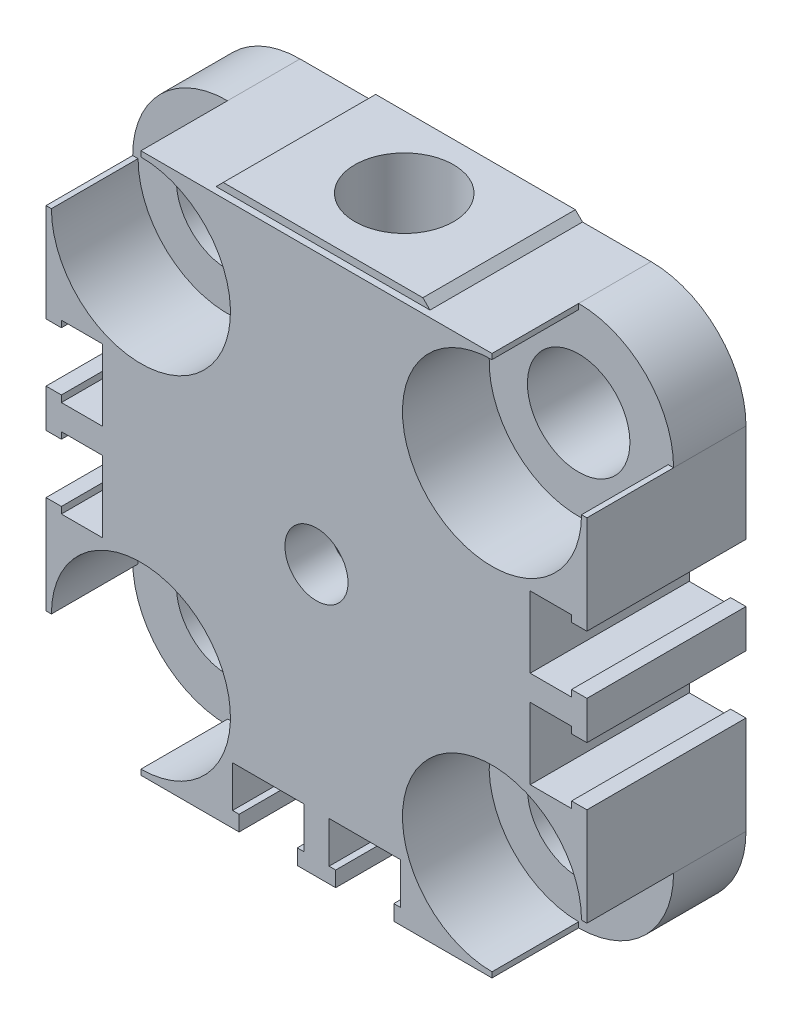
from build123d import *

# Parameters (mm, degrees)
EXTRUSION1_DEPTH                    = 14.5
ENL_V_MAT_EXTRU_1_DEPTH             = 7.9
ESQUISSE3_R                         = 4.67
ENL_V_MAT_EXTRU_2_DEPTH             = 7.9
R_P_TITION_CIRCULAIRE1_COUNT        = 4
ESQUISSE4_R                         = 2.875
ENL_V_MAT_EXTRU_3_DEPTH             = 4
ENL_V_MAT_EXTRU_4_DEPTH             = 38.755728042
R_P_TITION_CIRCULAIRE2_COUNT        = 3
R_P_TITION_CIRCULAIRE2_ANGLE        = 180
R_P_TITION_CIRCULAIRE2_COPY_1_DEPTH = 38.755728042
R_P_TITION_CIRCULAIRE2_COPY_2_DEPTH = 38.755728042
ESQUISSE7_W                         = 0.5
ESQUISSE7_H                         = 16
ESQUISSE9_W                         = 9
ESQUISSE9_H                         = 10.4
ESQUISSE9_W_2                       = 0.7
ESQUISSE9_H_2                       = 1.25
EXTRUSION2_DEPTH                    = 13.9
TROU_TARAUD_M10X1_01_D              = 9
TROU_TARAUD_M10X1_01_DEPTH          = 13
TROU_TARAUD_M10X1_01_TIP            = 2.703872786
ENL_V_MAT_EXTRU_5_REACH             = 40.183
ENL_V_MAT_EXTRU_5_END_RADIUS        = 4.5
ESQUISSE14_R                        = 0.85
ENL_V_MAT_EXTRU_5_DIRECTION_2_DEPTH = 39.183275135


with BuildPart() as part:
    # Esquisse1 → Extrusion1 (new body)
    with BuildSketch(Plane.XY):
        with BuildLine():
            Line((-16, 24.65), (16, 24.65))
            ThreePointArc((16, 24.65), (22.116473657, 22.116473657), (24.65, 16))
            Line((24.65, 16), (24.65, -16))
            ThreePointArc((24.65, -16), (22.116473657, -22.116473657), (16, -24.65))
            Line((16, -24.65), (-16, -24.65))
            ThreePointArc((-16, -24.65), (-22.116473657, -22.116473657), (-24.65, -16))
            Line((-24.65, -16), (-24.65, 16))
            ThreePointArc((-24.65, 16), (-22.116473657, 22.116473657), (-16, 24.65))
        make_face()
    extrude(amount=-EXTRUSION1_DEPTH)

    # Esquisse2 → Enl_v. mat.-Extru.1 (cut)
    with BuildSketch(Plane.XY):
        with BuildLine():
            Line((-16, 24.16), (-16, 24.65))
            ThreePointArc((-16, 24.65), (-22.116473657, 22.116473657), (-24.65, 16))
            Line((-24.65, 16), (-24.16, 16))
            ThreePointArc((-24.16, 16), (-10.230008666, 10.230008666), (-16, 24.16))
        make_face()
    enl_v_mat_extru_1 = extrude(amount=-ENL_V_MAT_EXTRU_1_DEPTH, mode=Mode.SUBTRACT)

    # Esquisse3 → Enl_v. mat.-Extru.2 (cut)
    with BuildSketch(Plane.XY.offset(-7.9)):
        with Locations((-16, 16)):
            Circle(ESQUISSE3_R)
    enl_v_mat_extru_2 = extrude(amount=-ENL_V_MAT_EXTRU_2_DEPTH, mode=Mode.SUBTRACT)

    # R_p_tition circulaire1: Enl_v. mat.-Extru.1, Enl_v. mat.-Extru.2 ×4 about axis
    r_p_tition_circulaire1_axis = Axis((0, 0, 0), (0, 0, 1))
    add([enl_v_mat_extru_1.rotate(r_p_tition_circulaire1_axis, i * 360 / R_P_TITION_CIRCULAIRE1_COUNT) for i in range(1, R_P_TITION_CIRCULAIRE1_COUNT)], mode=Mode.SUBTRACT)
    add([enl_v_mat_extru_2.rotate(r_p_tition_circulaire1_axis, i * 360 / R_P_TITION_CIRCULAIRE1_COUNT) for i in range(1, R_P_TITION_CIRCULAIRE1_COUNT)], mode=Mode.SUBTRACT)

    # Esquisse4 → Enl_v. mat.-Extru.3 (cut)
    with BuildSketch(Plane.XY):
        Circle(ESQUISSE4_R)
    extrude(amount=-ENL_V_MAT_EXTRU_3_DEPTH, mode=Mode.SUBTRACT)

    # Esquisse6 → Enl_v. mat.-Extru.4 (cut, through all)
    with BuildSketch(Plane.XY):
        Polygon((-24.65, 7.05), (-23.25, 7.05), (-23.25, 7.65), (-19.48, 7.65), (-19.48, 1.15), (-23.25, 1.15), (-23.25, 1.75), (-24.65, 1.75), align=None)
    enl_v_mat_extru_4 = extrude(amount=-ENL_V_MAT_EXTRU_4_DEPTH, mode=Mode.SUBTRACT)

    # Sym_trie1: Enl_v. mat.-Extru.4 across plane
    add(enl_v_mat_extru_4.mirror(Plane.ZX), mode=Mode.SUBTRACT)

    # R_p_tition circulaire2: Enl_v. mat.-Extru.4 ×3 about axis
    r_p_tition_circulaire2_axis = Axis((0, 0, 0), (0, 0, 1))
    for i in range(1, R_P_TITION_CIRCULAIRE2_COUNT):
        add(enl_v_mat_extru_4.rotate(r_p_tition_circulaire2_axis, i * R_P_TITION_CIRCULAIRE2_ANGLE / (R_P_TITION_CIRCULAIRE2_COUNT - 1)), mode=Mode.SUBTRACT)

    # R_p_tition circulaire2 copy 1 sketch → R_p_tition circulaire2 copy 1 (cut, through all)
    with BuildSketch(Plane(origin=(0, 0, 0), x_dir=(0, 1, 0), z_dir=(0, 0, 1))):
        Polygon((-24.65, -7.05), (-23.25, -7.05), (-23.25, -7.65), (-19.48, -7.65), (-19.48, -1.15), (-23.25, -1.15), (-23.25, -1.75), (-24.65, -1.75), align=None)
    extrude(amount=-R_P_TITION_CIRCULAIRE2_COPY_1_DEPTH, mode=Mode.SUBTRACT)

    # R_p_tition circulaire2 copy 2 sketch → R_p_tition circulaire2 copy 2 (cut, through all)
    with BuildSketch(Plane(origin=(0, 0, 0), x_dir=(-1, 0, 0), z_dir=(0, 0, 1))):
        Polygon((-24.65, -7.05), (-23.25, -7.05), (-23.25, -7.65), (-19.48, -7.65), (-19.48, -1.15), (-23.25, -1.15), (-23.25, -1.75), (-24.65, -1.75), align=None)
    extrude(amount=-R_P_TITION_CIRCULAIRE2_COPY_2_DEPTH, mode=Mode.SUBTRACT)

    # Esquisse7 → R_volution1 (revolve)
    with BuildSketch(Plane(origin=(0, 0, 0), x_dir=(0, 0, -1), z_dir=(1, 0, 0)), mode=Mode.PRIVATE) as r_volution1_sk:
        with Locations((14.75, 8)):
            Rectangle(ESQUISSE7_W, ESQUISSE7_H)
    revolve(r_volution1_sk.sketch.rotate(Axis((0, 0, -26.289994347), (0, 0, -1)), 90), axis=Axis((0, 0, -26.289994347), (0, 0, -1)))

    # Esquisse9 → Enl_vement de mati_re-R_volution3 (revolve, cut)
    with BuildSketch(Plane(origin=(0, 0, 0), x_dir=(0, 0, -1), z_dir=(1, 0, 0)), mode=Mode.PRIVATE) as enl_vement_de_mati_re_r_volution3_sk:
        with Locations((10.5, 5.2)):
            Rectangle(ESQUISSE9_W, ESQUISSE9_H)
        with Locations((14.15, 16.625)):
            Rectangle(ESQUISSE9_W_2, ESQUISSE9_H_2)
    revolve(enl_vement_de_mati_re_r_volution3_sk.sketch.rotate(Axis((0, 0, -30.345608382), (0, 0, -1)), 90), axis=Axis((0, 0, -30.345608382), (0, 0, -1)), mode=Mode.SUBTRACT)

    # Esquisse10 → Extrusion2 (add)
    with BuildSketch(Plane(origin=(0, 0, -14.5), x_dir=(-1, 0, 0), z_dir=(0, 0, -1))):
        Polygon((-9.75, 24.65), (-9.1, 25.3), (9.1, 25.3), (9.75, 24.65), align=None)
    extrude(amount=-EXTRUSION2_DEPTH)

    # Trou taraud_ M10x1.01
    with Locations(Plane(origin=(0, 25.3, 0), x_dir=(-1, 0, 0), z_dir=(0, 1, 0))):
        with Locations((0, -8)):
            Hole(TROU_TARAUD_M10X1_01_D / 2, depth=TROU_TARAUD_M10X1_01_DEPTH)
            with Locations((0, 0, -(TROU_TARAUD_M10X1_01_DEPTH + TROU_TARAUD_M10X1_01_TIP / 2))):  # 118° drill point
                Cone(0, TROU_TARAUD_M10X1_01_D / 2, TROU_TARAUD_M10X1_01_TIP, mode=Mode.SUBTRACT)

    # Enl_v. mat.-Extru.5: up to this cylinder (the profile starts outside it)
    enl_v_mat_extru_5_end = Plane(origin=(0, 13.55, -8), z_dir=(0, 1, 0)) * Cylinder(ENL_V_MAT_EXTRU_5_END_RADIUS, 90.366, mode=Mode.PRIVATE)
    # Esquisse14 → Enl_v. mat.-Extru.5 (cut, up to the surface)
    with BuildSketch(Plane(origin=(0, 0, -14.5), x_dir=(-1, 0, 0), z_dir=(0, 0, -1)), mode=Mode.PRIVATE) as enl_v_mat_extru_5_sk1:
        with Locations((0, 13.55)):
            Circle(ESQUISSE14_R)
    enl_v_mat_extru_5_tool1 = extrude(enl_v_mat_extru_5_sk1.sketch, amount=-ENL_V_MAT_EXTRU_5_REACH, mode=Mode.PRIVATE) - enl_v_mat_extru_5_end
    add(enl_v_mat_extru_5_tool1.solids().sort_by_distance((0, 13.55, -14.5))[0], mode=Mode.SUBTRACT)

    # Esquisse14 → Enl_v. mat.-Extru.5 direction 2 (cut)
    with BuildSketch(Plane(origin=(0, 0, -14.5), x_dir=(-1, 0, 0), z_dir=(0, 0, -1))):
        with Locations((0, 13.55)):
            Circle(ESQUISSE14_R)
    extrude(amount=ENL_V_MAT_EXTRU_5_DIRECTION_2_DEPTH, mode=Mode.SUBTRACT)


solid = part.part
